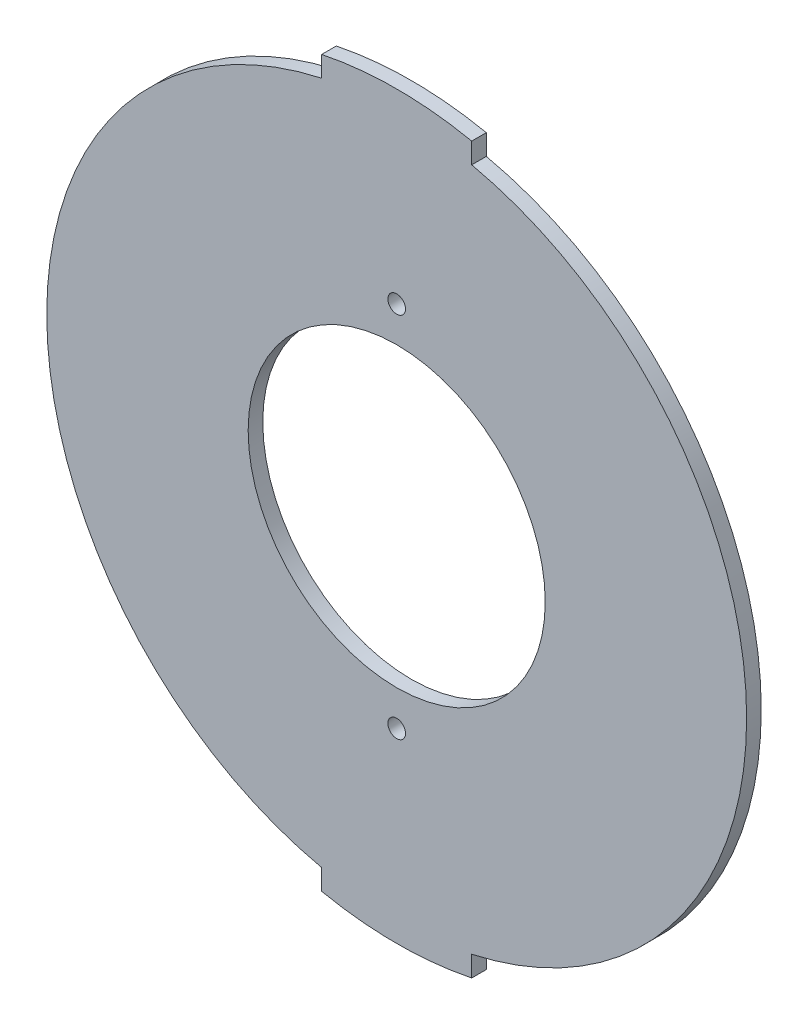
from build123d import *

# Parameters (mm, degrees)
ESQUISSE1_R      = 1.75
ESQUISSE1_R_2    = 29.5
EXTRUSION1_DEPTH = 2.9


with BuildPart() as part:
    # Esquisse1 → Extrusion1 (new body)
    with BuildSketch(Plane.XY):
        with BuildLine():
            Line((14.9, 71.973884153), (14.9, 67.884018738))
            ThreePointArc((14.9, 67.884018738), (69.5, 0), (14.9, -67.884018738))
            Line((14.9, -67.884018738), (14.9, -71.973884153))
            ThreePointArc((14.9, -71.973884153), (0, -73.5), (-14.9, -71.973884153))
            Line((-14.9, -71.973884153), (-14.9, -67.884018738))
            ThreePointArc((-14.9, -67.884018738), (-69.5, 0), (-14.9, 67.884018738))
            Line((-14.9, 67.884018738), (-14.9, 71.973884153))
            ThreePointArc((-14.9, 71.973884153), (0, 73.5), (14.9, 71.973884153))
        make_face()
        with Locations((0, 36.5)):
            Circle(ESQUISSE1_R, mode=Mode.SUBTRACT)
        with Locations((0, -36.5)):
            Circle(ESQUISSE1_R, mode=Mode.SUBTRACT)
        Circle(ESQUISSE1_R_2, mode=Mode.SUBTRACT)
    extrude(amount=EXTRUSION1_DEPTH)


solid = part.part
